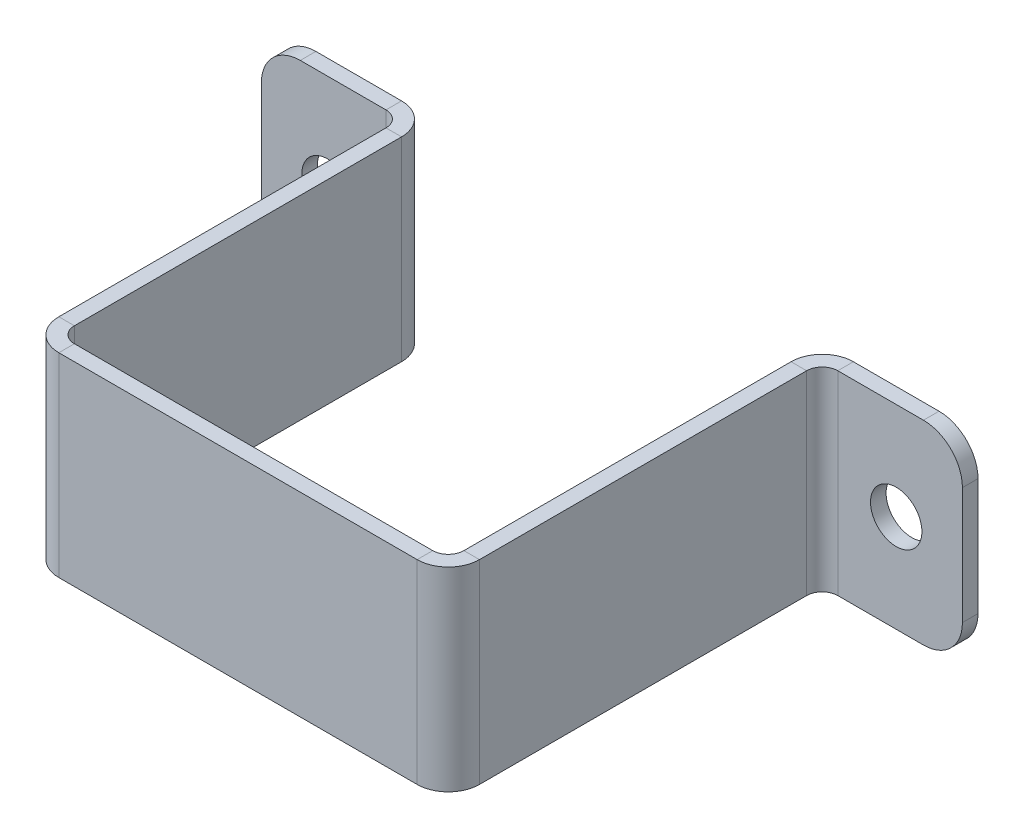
ISO-10303-21;
HEADER;
FILE_DESCRIPTION(('STEP AP214'),'2;1');
FILE_NAME('part.step','',(''),(''),'','','');
FILE_SCHEMA(('AUTOMOTIVE_DESIGN { 1 0 10303 214 1 1 1 1 }'));
ENDSEC;
DATA;
#1=APPLICATION_CONTEXT('core data for automotive mechanical design processes');
#2=APPLICATION_PROTOCOL_DEFINITION('international standard','automotive_design',2000,#1);
#3=PRODUCT_CONTEXT('',#1,'mechanical');
#4=PRODUCT('Part','Part','',(#3));
#5=PRODUCT_RELATED_PRODUCT_CATEGORY('part','',(#4));
#6=PRODUCT_DEFINITION_FORMATION('','',#4);
#7=PRODUCT_DEFINITION_CONTEXT('part definition',#1,'design');
#8=PRODUCT_DEFINITION('design','',#6,#7);
#9=PRODUCT_DEFINITION_SHAPE('','',#8);
#10=(LENGTH_UNIT() NAMED_UNIT(*) SI_UNIT(.MILLI.,.METRE.));
#11=(NAMED_UNIT(*) PLANE_ANGLE_UNIT() SI_UNIT($,.RADIAN.));
#12=(NAMED_UNIT(*) SI_UNIT($,.STERADIAN.) SOLID_ANGLE_UNIT());
#13=UNCERTAINTY_MEASURE_WITH_UNIT(LENGTH_MEASURE(1.E-05),#10,'distance_accuracy_value','');
#14=(GEOMETRIC_REPRESENTATION_CONTEXT(3) GLOBAL_UNCERTAINTY_ASSIGNED_CONTEXT((#13)) GLOBAL_UNIT_ASSIGNED_CONTEXT((#10,
#11,#12)) REPRESENTATION_CONTEXT('',''));
#15=CARTESIAN_POINT('',(0.,0.,0.));
#16=DIRECTION('',(0.,0.,1.));
#17=DIRECTION('',(1.,0.,0.));
#18=AXIS2_PLACEMENT_3D('',#15,#16,#17);
#19=CARTESIAN_POINT('',(2.00000000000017,0.,-48.));
#20=DIRECTION('',(0.,1.,0.));
#21=DIRECTION('',(0.,0.,1.));
#22=AXIS2_PLACEMENT_3D('',#19,#20,#21);
#23=PLANE('',#22);
#24=DIRECTION('',(-1.,0.,0.));
#25=VECTOR('',#24,1.);
#26=CARTESIAN_POINT('',(2.00000000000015,0.,-44.));
#27=LINE('',#26,#25);
#28=CARTESIAN_POINT('',(2.00000000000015,0.,-44.));
#29=VERTEX_POINT('',#28);
#30=CARTESIAN_POINT('',(1.53625267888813E-13,0.,-44.));
#31=VERTEX_POINT('',#30);
#32=EDGE_CURVE('E299',#29,#31,#27,.T.);
#33=ORIENTED_EDGE('',*,*,#32,.F.);
#34=DIRECTION('',(0.,0.,-1.));
#35=VECTOR('',#34,1.);
#36=CARTESIAN_POINT('',(2.00000000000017,0.,-48.));
#37=LINE('',#36,#35);
#38=CARTESIAN_POINT('',(2.00000000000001,0.,-1.99999999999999));
#39=VERTEX_POINT('',#38);
#40=EDGE_CURVE('E405',#39,#29,#37,.T.);
#41=ORIENTED_EDGE('',*,*,#40,.F.);
#42=DIRECTION('',(1.,0.,0.));
#43=VECTOR('',#42,1.);
#44=CARTESIAN_POINT('',(0.,0.,-1.99999999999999));
#45=LINE('',#44,#43);
#46=CARTESIAN_POINT('',(0.,0.,-1.99999999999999));
#47=VERTEX_POINT('',#46);
#48=EDGE_CURVE('E396',#47,#39,#45,.T.);
#49=ORIENTED_EDGE('',*,*,#48,.F.);
#50=DIRECTION('',(0.,0.,-1.));
#51=VECTOR('',#50,1.);
#52=CARTESIAN_POINT('',(1.6759120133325E-13,0.,-48.));
#53=LINE('',#52,#51);
#54=EDGE_CURVE('E404',#47,#31,#53,.T.);
#55=ORIENTED_EDGE('',*,*,#54,.T.);
#56=EDGE_LOOP('',(#33,#41,#49,#55));
#57=FACE_BOUND('',#56,.T.);
#58=ADVANCED_FACE('F74',(#57),#23,.F.);
#59=CARTESIAN_POINT('',(2.,25.,0.));
#60=DIRECTION('',(0.,-1.,0.));
#61=DIRECTION('',(0.,0.,-1.));
#62=AXIS2_PLACEMENT_3D('',#59,#60,#61);
#63=PLANE('',#62);
#64=DIRECTION('',(-1.,0.,0.));
#65=VECTOR('',#64,1.);
#66=CARTESIAN_POINT('',(2.00000000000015,25.,-44.));
#67=LINE('',#66,#65);
#68=CARTESIAN_POINT('',(2.00000000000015,25.,-44.));
#69=VERTEX_POINT('',#68);
#70=CARTESIAN_POINT('',(1.54390389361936E-13,25.,-44.));
#71=VERTEX_POINT('',#70);
#72=EDGE_CURVE('E292',#69,#71,#67,.T.);
#73=ORIENTED_EDGE('',*,*,#72,.T.);
#74=DIRECTION('',(0.,0.,1.));
#75=VECTOR('',#74,1.);
#76=CARTESIAN_POINT('',(0.,25.,0.));
#77=LINE('',#76,#75);
#78=CARTESIAN_POINT('',(0.,25.,-1.99999999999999));
#79=VERTEX_POINT('',#78);
#80=EDGE_CURVE('E409',#71,#79,#77,.T.);
#81=ORIENTED_EDGE('',*,*,#80,.T.);
#82=DIRECTION('',(1.,0.,0.));
#83=VECTOR('',#82,1.);
#84=CARTESIAN_POINT('',(0.,25.,-1.99999999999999));
#85=LINE('',#84,#83);
#86=CARTESIAN_POINT('',(2.00000000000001,25.,-1.99999999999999));
#87=VERTEX_POINT('',#86);
#88=EDGE_CURVE('E391',#79,#87,#85,.T.);
#89=ORIENTED_EDGE('',*,*,#88,.T.);
#90=DIRECTION('',(0.,0.,1.));
#91=VECTOR('',#90,1.);
#92=CARTESIAN_POINT('',(2.,25.,0.));
#93=LINE('',#92,#91);
#94=EDGE_CURVE('E408',#69,#87,#93,.T.);
#95=ORIENTED_EDGE('',*,*,#94,.F.);
#96=EDGE_LOOP('',(#73,#81,#89,#95));
#97=FACE_BOUND('',#96,.T.);
#98=ADVANCED_FACE('F548',(#97),#63,.F.);
#99=CARTESIAN_POINT('',(2.,0.,0.));
#100=DIRECTION('',(-1.,0.,0.));
#101=DIRECTION('',(0.,0.,1.));
#102=AXIS2_PLACEMENT_3D('',#99,#100,#101);
#103=PLANE('',#102);
#104=DIRECTION('',(0.,1.,0.));
#105=VECTOR('',#104,1.);
#106=CARTESIAN_POINT('',(2.00000000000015,25.,-44.));
#107=LINE('',#106,#105);
#108=EDGE_CURVE('E296',#69,#29,#107,.F.);
#109=ORIENTED_EDGE('',*,*,#108,.F.);
#110=ORIENTED_EDGE('',*,*,#94,.T.);
#111=DIRECTION('',(0.,1.,0.));
#112=VECTOR('',#111,1.);
#113=CARTESIAN_POINT('',(2.00000000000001,0.,-1.99999999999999));
#114=LINE('',#113,#112);
#115=EDGE_CURVE('E399',#39,#87,#114,.T.);
#116=ORIENTED_EDGE('',*,*,#115,.F.);
#117=ORIENTED_EDGE('',*,*,#40,.T.);
#118=EDGE_LOOP('',(#109,#110,#116,#117));
#119=FACE_BOUND('',#118,.T.);
#120=ADVANCED_FACE('F554',(#119),#103,.F.);
#121=CARTESIAN_POINT('',(0.,0.,0.));
#122=DIRECTION('',(-1.,0.,0.));
#123=DIRECTION('',(0.,0.,1.));
#124=AXIS2_PLACEMENT_3D('',#121,#122,#123);
#125=PLANE('',#124);
#126=ORIENTED_EDGE('',*,*,#80,.F.);
#127=DIRECTION('',(0.,1.,0.));
#128=VECTOR('',#127,1.);
#129=CARTESIAN_POINT('',(1.54390389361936E-13,25.,-44.));
#130=LINE('',#129,#128);
#131=EDGE_CURVE('E244',#71,#31,#130,.F.);
#132=ORIENTED_EDGE('',*,*,#131,.T.);
#133=ORIENTED_EDGE('',*,*,#54,.F.);
#134=DIRECTION('',(0.,-1.,0.));
#135=VECTOR('',#134,1.);
#136=CARTESIAN_POINT('',(0.,25.,-1.99999999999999));
#137=LINE('',#136,#135);
#138=EDGE_CURVE('E394',#79,#47,#137,.T.);
#139=ORIENTED_EDGE('',*,*,#138,.F.);
#140=EDGE_LOOP('',(#126,#132,#133,#139));
#141=FACE_BOUND('',#140,.T.);
#142=ADVANCED_FACE('F786',(#141),#125,.T.);
#143=CARTESIAN_POINT('',(-52.0000000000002,25.,-48.));
#144=DIRECTION('',(0.,-1.,0.));
#145=DIRECTION('',(0.,0.,-1.));
#146=AXIS2_PLACEMENT_3D('',#143,#144,#145);
#147=PLANE('',#146);
#148=DIRECTION('',(1.,0.,0.));
#149=VECTOR('',#148,1.);
#150=CARTESIAN_POINT('',(-52.0000000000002,25.,-44.));
#151=LINE('',#150,#149);
#152=CARTESIAN_POINT('',(-52.0000000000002,25.,-44.));
#153=VERTEX_POINT('',#152);
#154=CARTESIAN_POINT('',(-50.0000000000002,25.,-44.));
#155=VERTEX_POINT('',#154);
#156=EDGE_CURVE('E344',#153,#155,#151,.T.);
#157=ORIENTED_EDGE('',*,*,#156,.F.);
#158=DIRECTION('',(0.,0.,-1.));
#159=VECTOR('',#158,1.);
#160=CARTESIAN_POINT('',(-52.0000000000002,25.,-48.));
#161=LINE('',#160,#159);
#162=CARTESIAN_POINT('',(-52.,25.,-1.99999999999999));
#163=VERTEX_POINT('',#162);
#164=EDGE_CURVE('E361',#163,#153,#161,.T.);
#165=ORIENTED_EDGE('',*,*,#164,.F.);
#166=DIRECTION('',(-1.,0.,0.));
#167=VECTOR('',#166,1.);
#168=CARTESIAN_POINT('',(-50.,25.,-1.99999999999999));
#169=LINE('',#168,#167);
#170=CARTESIAN_POINT('',(-50.,25.,-1.99999999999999));
#171=VERTEX_POINT('',#170);
#172=EDGE_CURVE('E352',#171,#163,#169,.T.);
#173=ORIENTED_EDGE('',*,*,#172,.F.);
#174=DIRECTION('',(0.,0.,-1.));
#175=VECTOR('',#174,1.);
#176=CARTESIAN_POINT('',(-50.0000000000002,25.,-48.));
#177=LINE('',#176,#175);
#178=EDGE_CURVE('E360',#171,#155,#177,.T.);
#179=ORIENTED_EDGE('',*,*,#178,.T.);
#180=EDGE_LOOP('',(#157,#165,#173,#179));
#181=FACE_BOUND('',#180,.T.);
#182=ADVANCED_FACE('F516',(#181),#147,.F.);
#183=CARTESIAN_POINT('',(-52.,0.,0.));
#184=DIRECTION('',(0.,1.,0.));
#185=DIRECTION('',(0.,0.,1.));
#186=AXIS2_PLACEMENT_3D('',#183,#184,#185);
#187=PLANE('',#186);
#188=DIRECTION('',(1.,0.,0.));
#189=VECTOR('',#188,1.);
#190=CARTESIAN_POINT('',(-52.0000000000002,0.,-44.));
#191=LINE('',#190,#189);
#192=CARTESIAN_POINT('',(-52.0000000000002,0.,-44.));
#193=VERTEX_POINT('',#192);
#194=CARTESIAN_POINT('',(-50.0000000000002,0.,-44.));
#195=VERTEX_POINT('',#194);
#196=EDGE_CURVE('E334',#193,#195,#191,.T.);
#197=ORIENTED_EDGE('',*,*,#196,.T.);
#198=DIRECTION('',(0.,0.,1.));
#199=VECTOR('',#198,1.);
#200=CARTESIAN_POINT('',(-50.,0.,0.));
#201=LINE('',#200,#199);
#202=CARTESIAN_POINT('',(-50.,0.,-1.99999999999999));
#203=VERTEX_POINT('',#202);
#204=EDGE_CURVE('E365',#195,#203,#201,.T.);
#205=ORIENTED_EDGE('',*,*,#204,.T.);
#206=DIRECTION('',(-1.,0.,0.));
#207=VECTOR('',#206,1.);
#208=CARTESIAN_POINT('',(-50.,0.,-1.99999999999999));
#209=LINE('',#208,#207);
#210=CARTESIAN_POINT('',(-52.,0.,-1.99999999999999));
#211=VERTEX_POINT('',#210);
#212=EDGE_CURVE('E347',#203,#211,#209,.T.);
#213=ORIENTED_EDGE('',*,*,#212,.T.);
#214=DIRECTION('',(0.,0.,1.));
#215=VECTOR('',#214,1.);
#216=CARTESIAN_POINT('',(-52.,0.,0.));
#217=LINE('',#216,#215);
#218=EDGE_CURVE('E364',#193,#211,#217,.T.);
#219=ORIENTED_EDGE('',*,*,#218,.F.);
#220=EDGE_LOOP('',(#197,#205,#213,#219));
#221=FACE_BOUND('',#220,.T.);
#222=ADVANCED_FACE('F533',(#221),#187,.F.);
#223=CARTESIAN_POINT('',(-52.,25.,0.));
#224=DIRECTION('',(1.,0.,0.));
#225=DIRECTION('',(0.,0.,-1.));
#226=AXIS2_PLACEMENT_3D('',#223,#224,#225);
#227=PLANE('',#226);
#228=DIRECTION('',(0.,-1.,0.));
#229=VECTOR('',#228,1.);
#230=CARTESIAN_POINT('',(-52.0000000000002,0.,-44.));
#231=LINE('',#230,#229);
#232=EDGE_CURVE('E340',#193,#153,#231,.F.);
#233=ORIENTED_EDGE('',*,*,#232,.F.);
#234=ORIENTED_EDGE('',*,*,#218,.T.);
#235=DIRECTION('',(0.,-1.,0.));
#236=VECTOR('',#235,1.);
#237=CARTESIAN_POINT('',(-52.,25.,-1.99999999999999));
#238=LINE('',#237,#236);
#239=EDGE_CURVE('E355',#163,#211,#238,.T.);
#240=ORIENTED_EDGE('',*,*,#239,.F.);
#241=ORIENTED_EDGE('',*,*,#164,.T.);
#242=EDGE_LOOP('',(#233,#234,#240,#241));
#243=FACE_BOUND('',#242,.T.);
#244=ADVANCED_FACE('F523',(#243),#227,.F.);
#245=CARTESIAN_POINT('',(-50.,25.,0.));
#246=DIRECTION('',(1.,0.,0.));
#247=DIRECTION('',(0.,0.,-1.));
#248=AXIS2_PLACEMENT_3D('',#245,#246,#247);
#249=PLANE('',#248);
#250=ORIENTED_EDGE('',*,*,#204,.F.);
#251=DIRECTION('',(0.,-1.,0.));
#252=VECTOR('',#251,1.);
#253=CARTESIAN_POINT('',(-50.0000000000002,0.,-44.));
#254=LINE('',#253,#252);
#255=EDGE_CURVE('E327',#195,#155,#254,.F.);
#256=ORIENTED_EDGE('',*,*,#255,.T.);
#257=ORIENTED_EDGE('',*,*,#178,.F.);
#258=DIRECTION('',(0.,1.,0.));
#259=VECTOR('',#258,1.);
#260=CARTESIAN_POINT('',(-50.,0.,-1.99999999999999));
#261=LINE('',#260,#259);
#262=EDGE_CURVE('E350',#203,#171,#261,.T.);
#263=ORIENTED_EDGE('',*,*,#262,.F.);
#264=EDGE_LOOP('',(#250,#256,#257,#263));
#265=FACE_BOUND('',#264,.T.);
#266=ADVANCED_FACE('F513',(#265),#249,.T.);
#267=CARTESIAN_POINT('',(0.,25.,2.));
#268=DIRECTION('',(0.,-1.,0.));
#269=DIRECTION('',(1.,0.,0.));
#270=AXIS2_PLACEMENT_3D('',#267,#268,#269);
#271=PLANE('',#270);
#272=DIRECTION('',(0.,0.,1.));
#273=VECTOR('',#272,1.);
#274=CARTESIAN_POINT('',(-48.,25.,0.));
#275=LINE('',#274,#273);
#276=CARTESIAN_POINT('',(-48.,25.,0.));
#277=VERTEX_POINT('',#276);
#278=CARTESIAN_POINT('',(-48.,25.,2.));
#279=VERTEX_POINT('',#278);
#280=EDGE_CURVE('E378',#277,#279,#275,.T.);
#281=ORIENTED_EDGE('',*,*,#280,.T.);
#282=DIRECTION('',(-1.,0.,0.));
#283=VECTOR('',#282,1.);
#284=CARTESIAN_POINT('',(0.,25.,2.));
#285=LINE('',#284,#283);
#286=CARTESIAN_POINT('',(-1.99999999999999,25.,2.));
#287=VERTEX_POINT('',#286);
#288=EDGE_CURVE('E438',#287,#279,#285,.T.);
#289=ORIENTED_EDGE('',*,*,#288,.F.);
#290=DIRECTION('',(0.,0.,1.));
#291=VECTOR('',#290,1.);
#292=CARTESIAN_POINT('',(-1.99999999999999,25.,0.));
#293=LINE('',#292,#291);
#294=CARTESIAN_POINT('',(-1.99999999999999,25.,0.));
#295=VERTEX_POINT('',#294);
#296=EDGE_CURVE('E432',#295,#287,#293,.T.);
#297=ORIENTED_EDGE('',*,*,#296,.F.);
#298=DIRECTION('',(-1.,0.,0.));
#299=VECTOR('',#298,1.);
#300=CARTESIAN_POINT('',(0.,25.,0.));
#301=LINE('',#300,#299);
#302=EDGE_CURVE('E435',#295,#277,#301,.T.);
#303=ORIENTED_EDGE('',*,*,#302,.T.);
#304=EDGE_LOOP('',(#281,#289,#297,#303));
#305=FACE_BOUND('',#304,.T.);
#306=ADVANCED_FACE('F587',(#305),#271,.F.);
#307=CARTESIAN_POINT('',(0.,0.,2.));
#308=DIRECTION('',(0.,1.,0.));
#309=DIRECTION('',(-1.,0.,0.));
#310=AXIS2_PLACEMENT_3D('',#307,#308,#309);
#311=PLANE('',#310);
#312=DIRECTION('',(0.,0.,1.));
#313=VECTOR('',#312,1.);
#314=CARTESIAN_POINT('',(-48.,0.,0.));
#315=LINE('',#314,#313);
#316=CARTESIAN_POINT('',(-48.,0.,0.));
#317=VERTEX_POINT('',#316);
#318=CARTESIAN_POINT('',(-48.,0.,2.));
#319=VERTEX_POINT('',#318);
#320=EDGE_CURVE('E388',#317,#319,#315,.T.);
#321=ORIENTED_EDGE('',*,*,#320,.F.);
#322=DIRECTION('',(1.,0.,0.));
#323=VECTOR('',#322,1.);
#324=CARTESIAN_POINT('',(0.,0.,0.));
#325=LINE('',#324,#323);
#326=CARTESIAN_POINT('',(-1.99999999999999,0.,0.));
#327=VERTEX_POINT('',#326);
#328=EDGE_CURVE('E442',#317,#327,#325,.T.);
#329=ORIENTED_EDGE('',*,*,#328,.T.);
#330=DIRECTION('',(0.,0.,1.));
#331=VECTOR('',#330,1.);
#332=CARTESIAN_POINT('',(-1.99999999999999,0.,0.));
#333=LINE('',#332,#331);
#334=CARTESIAN_POINT('',(-1.99999999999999,0.,2.));
#335=VERTEX_POINT('',#334);
#336=EDGE_CURVE('E422',#327,#335,#333,.T.);
#337=ORIENTED_EDGE('',*,*,#336,.T.);
#338=DIRECTION('',(1.,0.,0.));
#339=VECTOR('',#338,1.);
#340=CARTESIAN_POINT('',(0.,0.,2.));
#341=LINE('',#340,#339);
#342=EDGE_CURVE('E441',#319,#335,#341,.T.);
#343=ORIENTED_EDGE('',*,*,#342,.F.);
#344=EDGE_LOOP('',(#321,#329,#337,#343));
#345=FACE_BOUND('',#344,.T.);
#346=ADVANCED_FACE('F580',(#345),#311,.F.);
#347=CARTESIAN_POINT('',(0.,25.,2.));
#348=DIRECTION('',(0.,0.,1.));
#349=DIRECTION('',(1.,0.,0.));
#350=AXIS2_PLACEMENT_3D('',#347,#348,#349);
#351=PLANE('',#350);
#352=ORIENTED_EDGE('',*,*,#288,.T.);
#353=DIRECTION('',(0.,1.,0.));
#354=VECTOR('',#353,1.);
#355=CARTESIAN_POINT('',(-48.,25.,2.));
#356=LINE('',#355,#354);
#357=EDGE_CURVE('E371',#279,#319,#356,.F.);
#358=ORIENTED_EDGE('',*,*,#357,.T.);
#359=ORIENTED_EDGE('',*,*,#342,.T.);
#360=DIRECTION('',(0.,-1.,0.));
#361=VECTOR('',#360,1.);
#362=CARTESIAN_POINT('',(-1.99999999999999,0.,2.));
#363=LINE('',#362,#361);
#364=EDGE_CURVE('E415',#335,#287,#363,.F.);
#365=ORIENTED_EDGE('',*,*,#364,.T.);
#366=EDGE_LOOP('',(#352,#358,#359,#365));
#367=FACE_BOUND('',#366,.T.);
#368=ADVANCED_FACE('F577',(#367),#351,.T.);
#369=CARTESIAN_POINT('',(0.,25.,0.));
#370=DIRECTION('',(0.,0.,1.));
#371=DIRECTION('',(1.,0.,0.));
#372=AXIS2_PLACEMENT_3D('',#369,#370,#371);
#373=PLANE('',#372);
#374=DIRECTION('',(0.,1.,0.));
#375=VECTOR('',#374,1.);
#376=CARTESIAN_POINT('',(-48.,25.,0.));
#377=LINE('',#376,#375);
#378=EDGE_CURVE('E384',#277,#317,#377,.F.);
#379=ORIENTED_EDGE('',*,*,#378,.F.);
#380=ORIENTED_EDGE('',*,*,#302,.F.);
#381=DIRECTION('',(0.,-1.,0.));
#382=VECTOR('',#381,1.);
#383=CARTESIAN_POINT('',(-1.99999999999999,0.,0.));
#384=LINE('',#383,#382);
#385=EDGE_CURVE('E428',#327,#295,#384,.F.);
#386=ORIENTED_EDGE('',*,*,#385,.F.);
#387=ORIENTED_EDGE('',*,*,#328,.F.);
#388=EDGE_LOOP('',(#379,#380,#386,#387));
#389=FACE_BOUND('',#388,.T.);
#390=ADVANCED_FACE('F572',(#389),#373,.F.);
#391=CARTESIAN_POINT('',(-1.99999999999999,25.,-2.));
#392=DIRECTION('',(0.,1.,0.));
#393=DIRECTION('',(0.,0.,1.));
#394=AXIS2_PLACEMENT_3D('',#391,#392,#393);
#395=PLANE('',#394);
#396=ORIENTED_EDGE('',*,*,#88,.F.);
#397=CARTESIAN_POINT('',(-1.99999999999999,25.,-2.));
#398=DIRECTION('',(0.,-1.,0.));
#399=DIRECTION('',(0.,0.,-1.));
#400=AXIS2_PLACEMENT_3D('',#397,#398,#399);
#401=CIRCLE('',#400,2.);
#402=EDGE_CURVE('E425',#295,#79,#401,.F.);
#403=ORIENTED_EDGE('',*,*,#402,.F.);
#404=ORIENTED_EDGE('',*,*,#296,.T.);
#405=CARTESIAN_POINT('',(-1.99999999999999,25.,-2.));
#406=DIRECTION('',(0.,-1.,0.));
#407=DIRECTION('',(0.,0.,-1.));
#408=AXIS2_PLACEMENT_3D('',#405,#406,#407);
#409=CIRCLE('',#408,4.);
#410=EDGE_CURVE('E418',#287,#87,#409,.F.);
#411=ORIENTED_EDGE('',*,*,#410,.T.);
#412=EDGE_LOOP('',(#396,#403,#404,#411));
#413=FACE_BOUND('',#412,.T.);
#414=ADVANCED_FACE('F566',(#413),#395,.T.);
#415=CARTESIAN_POINT('',(-1.99999999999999,0.,-2.));
#416=DIRECTION('',(0.,1.,0.));
#417=DIRECTION('',(0.,0.,1.));
#418=AXIS2_PLACEMENT_3D('',#415,#416,#417);
#419=PLANE('',#418);
#420=CARTESIAN_POINT('',(-1.99999999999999,0.,-2.));
#421=DIRECTION('',(0.,-1.,0.));
#422=DIRECTION('',(0.,0.,-1.));
#423=AXIS2_PLACEMENT_3D('',#420,#421,#422);
#424=CIRCLE('',#423,2.);
#425=EDGE_CURVE('E411',#47,#327,#424,.T.);
#426=ORIENTED_EDGE('',*,*,#425,.F.);
#427=ORIENTED_EDGE('',*,*,#48,.T.);
#428=CARTESIAN_POINT('',(-1.99999999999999,0.,-2.));
#429=DIRECTION('',(0.,-1.,0.));
#430=DIRECTION('',(0.,0.,-1.));
#431=AXIS2_PLACEMENT_3D('',#428,#429,#430);
#432=CIRCLE('',#431,4.);
#433=EDGE_CURVE('E419',#39,#335,#432,.T.);
#434=ORIENTED_EDGE('',*,*,#433,.T.);
#435=ORIENTED_EDGE('',*,*,#336,.F.);
#436=EDGE_LOOP('',(#426,#427,#434,#435));
#437=FACE_BOUND('',#436,.T.);
#438=ADVANCED_FACE('F564',(#437),#419,.F.);
#439=CARTESIAN_POINT('',(-1.99999999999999,0.,-2.));
#440=DIRECTION('',(0.,-1.,0.));
#441=DIRECTION('',(1.,0.,0.));
#442=AXIS2_PLACEMENT_3D('',#439,#440,#441);
#443=CYLINDRICAL_SURFACE('',#442,4.);
#444=ORIENTED_EDGE('',*,*,#364,.F.);
#445=ORIENTED_EDGE('',*,*,#433,.F.);
#446=ORIENTED_EDGE('',*,*,#115,.T.);
#447=ORIENTED_EDGE('',*,*,#410,.F.);
#448=EDGE_LOOP('',(#444,#445,#446,#447));
#449=FACE_BOUND('',#448,.T.);
#450=ADVANCED_FACE('F560',(#449),#443,.T.);
#451=CARTESIAN_POINT('',(-1.99999999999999,0.,-2.));
#452=DIRECTION('',(0.,-1.,0.));
#453=DIRECTION('',(1.,0.,0.));
#454=AXIS2_PLACEMENT_3D('',#451,#452,#453);
#455=CYLINDRICAL_SURFACE('',#454,2.);
#456=ORIENTED_EDGE('',*,*,#385,.T.);
#457=ORIENTED_EDGE('',*,*,#402,.T.);
#458=ORIENTED_EDGE('',*,*,#138,.T.);
#459=ORIENTED_EDGE('',*,*,#425,.T.);
#460=EDGE_LOOP('',(#456,#457,#458,#459));
#461=FACE_BOUND('',#460,.T.);
#462=ADVANCED_FACE('F563',(#461),#455,.F.);
#463=CARTESIAN_POINT('',(-48.,0.,-2.));
#464=DIRECTION('',(0.,-1.,0.));
#465=DIRECTION('',(0.,0.,-1.));
#466=AXIS2_PLACEMENT_3D('',#463,#464,#465);
#467=PLANE('',#466);
#468=ORIENTED_EDGE('',*,*,#212,.F.);
#469=CARTESIAN_POINT('',(-48.,0.,-2.));
#470=DIRECTION('',(0.,1.,0.));
#471=DIRECTION('',(0.,0.,1.));
#472=AXIS2_PLACEMENT_3D('',#469,#470,#471);
#473=CIRCLE('',#472,2.);
#474=EDGE_CURVE('E381',#317,#203,#473,.F.);
#475=ORIENTED_EDGE('',*,*,#474,.F.);
#476=ORIENTED_EDGE('',*,*,#320,.T.);
#477=CARTESIAN_POINT('',(-48.,0.,-2.));
#478=DIRECTION('',(0.,1.,0.));
#479=DIRECTION('',(0.,0.,1.));
#480=AXIS2_PLACEMENT_3D('',#477,#478,#479);
#481=CIRCLE('',#480,4.);
#482=EDGE_CURVE('E374',#319,#211,#481,.F.);
#483=ORIENTED_EDGE('',*,*,#482,.T.);
#484=EDGE_LOOP('',(#468,#475,#476,#483));
#485=FACE_BOUND('',#484,.T.);
#486=ADVANCED_FACE('F529',(#485),#467,.T.);
#487=CARTESIAN_POINT('',(-48.,25.,-2.));
#488=DIRECTION('',(0.,-1.,0.));
#489=DIRECTION('',(0.,0.,-1.));
#490=AXIS2_PLACEMENT_3D('',#487,#488,#489);
#491=PLANE('',#490);
#492=CARTESIAN_POINT('',(-48.,25.,-2.));
#493=DIRECTION('',(0.,1.,0.));
#494=DIRECTION('',(0.,0.,1.));
#495=AXIS2_PLACEMENT_3D('',#492,#493,#494);
#496=CIRCLE('',#495,2.);
#497=EDGE_CURVE('E367',#171,#277,#496,.T.);
#498=ORIENTED_EDGE('',*,*,#497,.F.);
#499=ORIENTED_EDGE('',*,*,#172,.T.);
#500=CARTESIAN_POINT('',(-48.,25.,-2.));
#501=DIRECTION('',(0.,1.,0.));
#502=DIRECTION('',(0.,0.,1.));
#503=AXIS2_PLACEMENT_3D('',#500,#501,#502);
#504=CIRCLE('',#503,4.);
#505=EDGE_CURVE('E375',#163,#279,#504,.T.);
#506=ORIENTED_EDGE('',*,*,#505,.T.);
#507=ORIENTED_EDGE('',*,*,#280,.F.);
#508=EDGE_LOOP('',(#498,#499,#506,#507));
#509=FACE_BOUND('',#508,.T.);
#510=ADVANCED_FACE('F520',(#509),#491,.F.);
#511=CARTESIAN_POINT('',(-48.,25.,-2.));
#512=DIRECTION('',(0.,1.,0.));
#513=DIRECTION('',(-1.,0.,0.));
#514=AXIS2_PLACEMENT_3D('',#511,#512,#513);
#515=CYLINDRICAL_SURFACE('',#514,4.);
#516=ORIENTED_EDGE('',*,*,#357,.F.);
#517=ORIENTED_EDGE('',*,*,#505,.F.);
#518=ORIENTED_EDGE('',*,*,#239,.T.);
#519=ORIENTED_EDGE('',*,*,#482,.F.);
#520=EDGE_LOOP('',(#516,#517,#518,#519));
#521=FACE_BOUND('',#520,.T.);
#522=ADVANCED_FACE('F526',(#521),#515,.T.);
#523=CARTESIAN_POINT('',(-48.,25.,-2.));
#524=DIRECTION('',(0.,1.,0.));
#525=DIRECTION('',(-1.,0.,0.));
#526=AXIS2_PLACEMENT_3D('',#523,#524,#525);
#527=CYLINDRICAL_SURFACE('',#526,2.);
#528=ORIENTED_EDGE('',*,*,#378,.T.);
#529=ORIENTED_EDGE('',*,*,#474,.T.);
#530=ORIENTED_EDGE('',*,*,#262,.T.);
#531=ORIENTED_EDGE('',*,*,#497,.T.);
#532=EDGE_LOOP('',(#528,#529,#530,#531));
#533=FACE_BOUND('',#532,.T.);
#534=ADVANCED_FACE('F835',(#533),#527,.F.);
#535=CARTESIAN_POINT('',(-54.0000000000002,25.,-44.));
#536=DIRECTION('',(0.,1.,0.));
#537=DIRECTION('',(0.,0.,1.));
#538=AXIS2_PLACEMENT_3D('',#535,#536,#537);
#539=PLANE('',#538);
#540=DIRECTION('',(0.,0.,1.));
#541=VECTOR('',#540,1.);
#542=CARTESIAN_POINT('',(-54.0000000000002,25.,-48.));
#543=LINE('',#542,#541);
#544=CARTESIAN_POINT('',(-54.0000000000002,25.,-46.));
#545=VERTEX_POINT('',#544);
#546=CARTESIAN_POINT('',(-54.0000000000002,25.,-48.));
#547=VERTEX_POINT('',#546);
#548=EDGE_CURVE('E302',#545,#547,#543,.F.);
#549=ORIENTED_EDGE('',*,*,#548,.F.);
#550=CARTESIAN_POINT('',(-54.0000000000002,25.,-44.));
#551=DIRECTION('',(0.,-1.,0.));
#552=DIRECTION('',(0.,0.,-1.));
#553=AXIS2_PLACEMENT_3D('',#550,#551,#552);
#554=CIRCLE('',#553,2.);
#555=EDGE_CURVE('E337',#153,#545,#554,.F.);
#556=ORIENTED_EDGE('',*,*,#555,.F.);
#557=ORIENTED_EDGE('',*,*,#156,.T.);
#558=CARTESIAN_POINT('',(-54.0000000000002,25.,-44.));
#559=DIRECTION('',(0.,-1.,0.));
#560=DIRECTION('',(0.,0.,-1.));
#561=AXIS2_PLACEMENT_3D('',#558,#559,#560);
#562=CIRCLE('',#561,4.);
#563=EDGE_CURVE('E330',#155,#547,#562,.F.);
#564=ORIENTED_EDGE('',*,*,#563,.T.);
#565=EDGE_LOOP('',(#549,#556,#557,#564));
#566=FACE_BOUND('',#565,.T.);
#567=ADVANCED_FACE('F505',(#566),#539,.T.);
#568=CARTESIAN_POINT('',(-54.0000000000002,0.,-44.));
#569=DIRECTION('',(0.,1.,0.));
#570=DIRECTION('',(0.,0.,1.));
#571=AXIS2_PLACEMENT_3D('',#568,#569,#570);
#572=PLANE('',#571);
#573=CARTESIAN_POINT('',(-54.0000000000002,0.,-44.));
#574=DIRECTION('',(0.,-1.,0.));
#575=DIRECTION('',(0.,0.,-1.));
#576=AXIS2_PLACEMENT_3D('',#573,#574,#575);
#577=CIRCLE('',#576,2.);
#578=CARTESIAN_POINT('',(-54.0000000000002,0.,-46.));
#579=VERTEX_POINT('',#578);
#580=EDGE_CURVE('E306',#579,#193,#577,.T.);
#581=ORIENTED_EDGE('',*,*,#580,.F.);
#582=DIRECTION('',(0.,0.,1.));
#583=VECTOR('',#582,1.);
#584=CARTESIAN_POINT('',(-54.0000000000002,0.,-46.));
#585=LINE('',#584,#583);
#586=CARTESIAN_POINT('',(-54.0000000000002,0.,-48.));
#587=VERTEX_POINT('',#586);
#588=EDGE_CURVE('E320',#579,#587,#585,.F.);
#589=ORIENTED_EDGE('',*,*,#588,.T.);
#590=CARTESIAN_POINT('',(-54.0000000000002,0.,-44.));
#591=DIRECTION('',(0.,-1.,0.));
#592=DIRECTION('',(0.,0.,-1.));
#593=AXIS2_PLACEMENT_3D('',#590,#591,#592);
#594=CIRCLE('',#593,4.);
#595=EDGE_CURVE('E331',#587,#195,#594,.T.);
#596=ORIENTED_EDGE('',*,*,#595,.T.);
#597=ORIENTED_EDGE('',*,*,#196,.F.);
#598=EDGE_LOOP('',(#581,#589,#596,#597));
#599=FACE_BOUND('',#598,.T.);
#600=ADVANCED_FACE('F501',(#599),#572,.F.);
#601=CARTESIAN_POINT('',(-54.0000000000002,0.,-44.));
#602=DIRECTION('',(0.,-1.,0.));
#603=DIRECTION('',(0.,0.,-1.));
#604=AXIS2_PLACEMENT_3D('',#601,#602,#603);
#605=CYLINDRICAL_SURFACE('',#604,4.);
#606=ORIENTED_EDGE('',*,*,#255,.F.);
#607=ORIENTED_EDGE('',*,*,#595,.F.);
#608=DIRECTION('',(0.,-1.,0.));
#609=VECTOR('',#608,1.);
#610=CARTESIAN_POINT('',(-54.0000000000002,25.,-48.));
#611=LINE('',#610,#609);
#612=EDGE_CURVE('E317',#587,#547,#611,.F.);
#613=ORIENTED_EDGE('',*,*,#612,.T.);
#614=ORIENTED_EDGE('',*,*,#563,.F.);
#615=EDGE_LOOP('',(#606,#607,#613,#614));
#616=FACE_BOUND('',#615,.T.);
#617=ADVANCED_FACE('F503',(#616),#605,.T.);
#618=CARTESIAN_POINT('',(-54.0000000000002,0.,-44.));
#619=DIRECTION('',(0.,-1.,0.));
#620=DIRECTION('',(0.,0.,-1.));
#621=AXIS2_PLACEMENT_3D('',#618,#619,#620);
#622=CYLINDRICAL_SURFACE('',#621,2.);
#623=ORIENTED_EDGE('',*,*,#232,.T.);
#624=ORIENTED_EDGE('',*,*,#555,.T.);
#625=DIRECTION('',(0.,-1.,0.));
#626=VECTOR('',#625,1.);
#627=CARTESIAN_POINT('',(-54.0000000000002,25.,-46.));
#628=LINE('',#627,#626);
#629=EDGE_CURVE('E323',#545,#579,#628,.T.);
#630=ORIENTED_EDGE('',*,*,#629,.T.);
#631=ORIENTED_EDGE('',*,*,#580,.T.);
#632=EDGE_LOOP('',(#623,#624,#630,#631));
#633=FACE_BOUND('',#632,.T.);
#634=ADVANCED_FACE('F535',(#633),#622,.F.);
#635=CARTESIAN_POINT('',(-52.0000000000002,25.,-48.));
#636=DIRECTION('',(0.,-1.,0.));
#637=DIRECTION('',(0.,0.,-1.));
#638=AXIS2_PLACEMENT_3D('',#635,#636,#637);
#639=PLANE('',#638);
#640=DIRECTION('',(1.,0.,0.));
#641=VECTOR('',#640,1.);
#642=CARTESIAN_POINT('',(-70.0000000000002,25.,-48.));
#643=LINE('',#642,#641);
#644=CARTESIAN_POINT('',(-65.0000000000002,25.,-48.));
#645=VERTEX_POINT('',#644);
#646=EDGE_CURVE('E309',#645,#547,#643,.T.);
#647=ORIENTED_EDGE('',*,*,#646,.F.);
#648=DIRECTION('',(0.,0.,1.));
#649=VECTOR('',#648,1.);
#650=CARTESIAN_POINT('',(-65.0000000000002,25.,-48.));
#651=LINE('',#650,#649);
#652=CARTESIAN_POINT('',(-65.0000000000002,25.,-46.));
#653=VERTEX_POINT('',#652);
#654=EDGE_CURVE('E464',#645,#653,#651,.T.);
#655=ORIENTED_EDGE('',*,*,#654,.T.);
#656=DIRECTION('',(-1.,0.,0.));
#657=VECTOR('',#656,1.);
#658=CARTESIAN_POINT('',(-52.0000000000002,25.,-46.));
#659=LINE('',#658,#657);
#660=EDGE_CURVE('E315',#653,#545,#659,.F.);
#661=ORIENTED_EDGE('',*,*,#660,.T.);
#662=ORIENTED_EDGE('',*,*,#548,.T.);
#663=EDGE_LOOP('',(#647,#655,#661,#662));
#664=FACE_BOUND('',#663,.T.);
#665=ADVANCED_FACE('F484',(#664),#639,.F.);
#666=CARTESIAN_POINT('',(-70.0000000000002,0.,-48.));
#667=DIRECTION('',(0.,1.,0.));
#668=DIRECTION('',(0.,0.,1.));
#669=AXIS2_PLACEMENT_3D('',#666,#667,#668);
#670=PLANE('',#669);
#671=DIRECTION('',(1.,0.,0.));
#672=VECTOR('',#671,1.);
#673=CARTESIAN_POINT('',(-70.0000000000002,0.,-46.));
#674=LINE('',#673,#672);
#675=CARTESIAN_POINT('',(-65.0000000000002,0.,-46.));
#676=VERTEX_POINT('',#675);
#677=EDGE_CURVE('E313',#579,#676,#674,.F.);
#678=ORIENTED_EDGE('',*,*,#677,.T.);
#679=DIRECTION('',(0.,0.,1.));
#680=VECTOR('',#679,1.);
#681=CARTESIAN_POINT('',(-65.0000000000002,0.,-48.));
#682=LINE('',#681,#680);
#683=CARTESIAN_POINT('',(-65.0000000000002,0.,-48.));
#684=VERTEX_POINT('',#683);
#685=EDGE_CURVE('E13',#676,#684,#682,.F.);
#686=ORIENTED_EDGE('',*,*,#685,.T.);
#687=DIRECTION('',(-1.,0.,0.));
#688=VECTOR('',#687,1.);
#689=CARTESIAN_POINT('',(-70.0000000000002,0.,-48.));
#690=LINE('',#689,#688);
#691=EDGE_CURVE('E307',#587,#684,#690,.T.);
#692=ORIENTED_EDGE('',*,*,#691,.F.);
#693=ORIENTED_EDGE('',*,*,#588,.F.);
#694=EDGE_LOOP('',(#678,#686,#692,#693));
#695=FACE_BOUND('',#694,.T.);
#696=ADVANCED_FACE('F498',(#695),#670,.F.);
#697=CARTESIAN_POINT('',(-70.0000000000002,25.,-48.));
#698=DIRECTION('',(0.,0.,1.));
#699=DIRECTION('',(1.,0.,0.));
#700=AXIS2_PLACEMENT_3D('',#697,#698,#699);
#701=PLANE('',#700);
#702=CARTESIAN_POINT('',(-61.4999999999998,12.5,-48.));
#703=DIRECTION('',(0.,0.,1.));
#704=DIRECTION('',(1.,0.,0.));
#705=AXIS2_PLACEMENT_3D('',#702,#703,#704);
#706=CIRCLE('',#705,3.3);
#707=CARTESIAN_POINT('',(-58.1999999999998,12.5,-48.));
#708=VERTEX_POINT('',#707);
#709=EDGE_CURVE('E1020',#708,#708,#706,.T.);
#710=ORIENTED_EDGE('',*,*,#709,.T.);
#711=EDGE_LOOP('',(#710));
#712=FACE_BOUND('',#711,.T.);
#713=DIRECTION('',(0.,1.,0.));
#714=VECTOR('',#713,1.);
#715=CARTESIAN_POINT('',(-70.0000000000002,25.,-48.));
#716=LINE('',#715,#714);
#717=CARTESIAN_POINT('',(-70.0000000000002,4.99999999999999,-48.));
#718=VERTEX_POINT('',#717);
#719=CARTESIAN_POINT('',(-70.0000000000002,20.,-48.));
#720=VERTEX_POINT('',#719);
#721=EDGE_CURVE('E304',#718,#720,#716,.T.);
#722=ORIENTED_EDGE('',*,*,#721,.T.);
#723=CARTESIAN_POINT('',(-65.0000000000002,20.,-48.));
#724=DIRECTION('',(0.,0.,1.));
#725=DIRECTION('',(1.,0.,0.));
#726=AXIS2_PLACEMENT_3D('',#723,#724,#725);
#727=CIRCLE('',#726,5.);
#728=EDGE_CURVE('E82',#720,#645,#727,.F.);
#729=ORIENTED_EDGE('',*,*,#728,.T.);
#730=ORIENTED_EDGE('',*,*,#646,.T.);
#731=ORIENTED_EDGE('',*,*,#612,.F.);
#732=ORIENTED_EDGE('',*,*,#691,.T.);
#733=CARTESIAN_POINT('',(-65.0000000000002,4.99999999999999,-48.));
#734=DIRECTION('',(0.,0.,1.));
#735=DIRECTION('',(1.,0.,0.));
#736=AXIS2_PLACEMENT_3D('',#733,#734,#735);
#737=CIRCLE('',#736,5.);
#738=EDGE_CURVE('E475',#684,#718,#737,.F.);
#739=ORIENTED_EDGE('',*,*,#738,.T.);
#740=EDGE_LOOP('',(#722,#729,#730,#731,#732,#739));
#741=FACE_BOUND('',#740,.T.);
#742=ADVANCED_FACE('F479',(#712,#741),#701,.F.);
#743=CARTESIAN_POINT('',(-70.0000000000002,25.,-46.));
#744=DIRECTION('',(0.,0.,1.));
#745=DIRECTION('',(1.,0.,0.));
#746=AXIS2_PLACEMENT_3D('',#743,#744,#745);
#747=PLANE('',#746);
#748=CARTESIAN_POINT('',(-61.4999999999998,12.5,-46.));
#749=DIRECTION('',(0.,0.,1.));
#750=DIRECTION('',(1.,0.,0.));
#751=AXIS2_PLACEMENT_3D('',#748,#749,#750);
#752=CIRCLE('',#751,3.3);
#753=CARTESIAN_POINT('',(-58.1999999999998,12.5,-46.));
#754=VERTEX_POINT('',#753);
#755=EDGE_CURVE('E1023',#754,#754,#752,.T.);
#756=ORIENTED_EDGE('',*,*,#755,.F.);
#757=EDGE_LOOP('',(#756));
#758=FACE_BOUND('',#757,.T.);
#759=ORIENTED_EDGE('',*,*,#660,.F.);
#760=CARTESIAN_POINT('',(-65.0000000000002,20.,-46.));
#761=DIRECTION('',(0.,0.,1.));
#762=DIRECTION('',(1.,0.,0.));
#763=AXIS2_PLACEMENT_3D('',#760,#761,#762);
#764=CIRCLE('',#763,5.);
#765=CARTESIAN_POINT('',(-70.0000000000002,20.,-46.));
#766=VERTEX_POINT('',#765);
#767=EDGE_CURVE('E469',#653,#766,#764,.T.);
#768=ORIENTED_EDGE('',*,*,#767,.T.);
#769=DIRECTION('',(0.,-1.,0.));
#770=VECTOR('',#769,1.);
#771=CARTESIAN_POINT('',(-70.0000000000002,25.,-46.));
#772=LINE('',#771,#770);
#773=CARTESIAN_POINT('',(-70.0000000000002,4.99999999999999,-46.));
#774=VERTEX_POINT('',#773);
#775=EDGE_CURVE('E311',#774,#766,#772,.F.);
#776=ORIENTED_EDGE('',*,*,#775,.F.);
#777=CARTESIAN_POINT('',(-65.0000000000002,4.99999999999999,-46.));
#778=DIRECTION('',(0.,0.,1.));
#779=DIRECTION('',(1.,0.,0.));
#780=AXIS2_PLACEMENT_3D('',#777,#778,#779);
#781=CIRCLE('',#780,5.);
#782=EDGE_CURVE('E467',#774,#676,#781,.T.);
#783=ORIENTED_EDGE('',*,*,#782,.T.);
#784=ORIENTED_EDGE('',*,*,#677,.F.);
#785=ORIENTED_EDGE('',*,*,#629,.F.);
#786=EDGE_LOOP('',(#759,#768,#776,#783,#784,#785));
#787=FACE_BOUND('',#786,.T.);
#788=ADVANCED_FACE('F490',(#758,#787),#747,.T.);
#789=CARTESIAN_POINT('',(-70.0000000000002,25.,-48.));
#790=DIRECTION('',(1.,0.,0.));
#791=DIRECTION('',(0.,0.,-1.));
#792=AXIS2_PLACEMENT_3D('',#789,#790,#791);
#793=PLANE('',#792);
#794=ORIENTED_EDGE('',*,*,#775,.T.);
#795=DIRECTION('',(0.,0.,1.));
#796=VECTOR('',#795,1.);
#797=CARTESIAN_POINT('',(-70.0000000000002,20.,-48.));
#798=LINE('',#797,#796);
#799=EDGE_CURVE('E95',#766,#720,#798,.F.);
#800=ORIENTED_EDGE('',*,*,#799,.T.);
#801=ORIENTED_EDGE('',*,*,#721,.F.);
#802=DIRECTION('',(0.,0.,1.));
#803=VECTOR('',#802,1.);
#804=CARTESIAN_POINT('',(-70.0000000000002,4.99999999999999,-48.));
#805=LINE('',#804,#803);
#806=EDGE_CURVE('E471',#718,#774,#805,.T.);
#807=ORIENTED_EDGE('',*,*,#806,.T.);
#808=EDGE_LOOP('',(#794,#800,#801,#807));
#809=FACE_BOUND('',#808,.T.);
#810=ADVANCED_FACE('F492',(#809),#793,.F.);
#811=CARTESIAN_POINT('',(4.00000000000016,0.,-44.));
#812=DIRECTION('',(0.,-1.,0.));
#813=DIRECTION('',(0.,0.,-1.));
#814=AXIS2_PLACEMENT_3D('',#811,#812,#813);
#815=PLANE('',#814);
#816=DIRECTION('',(0.,0.,1.));
#817=VECTOR('',#816,1.);
#818=CARTESIAN_POINT('',(4.00000000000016,0.,-48.));
#819=LINE('',#818,#817);
#820=CARTESIAN_POINT('',(4.00000000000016,0.,-46.));
#821=VERTEX_POINT('',#820);
#822=CARTESIAN_POINT('',(4.00000000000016,0.,-48.));
#823=VERTEX_POINT('',#822);
#824=EDGE_CURVE('E286',#821,#823,#819,.F.);
#825=ORIENTED_EDGE('',*,*,#824,.F.);
#826=CARTESIAN_POINT('',(4.00000000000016,0.,-44.));
#827=DIRECTION('',(0.,1.,0.));
#828=DIRECTION('',(0.,0.,1.));
#829=AXIS2_PLACEMENT_3D('',#826,#827,#828);
#830=CIRCLE('',#829,2.);
#831=EDGE_CURVE('E247',#29,#821,#830,.F.);
#832=ORIENTED_EDGE('',*,*,#831,.F.);
#833=ORIENTED_EDGE('',*,*,#32,.T.);
#834=CARTESIAN_POINT('',(4.00000000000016,0.,-44.));
#835=DIRECTION('',(0.,1.,0.));
#836=DIRECTION('',(0.,0.,1.));
#837=AXIS2_PLACEMENT_3D('',#834,#835,#836);
#838=CIRCLE('',#837,4.);
#839=EDGE_CURVE('E291',#31,#823,#838,.F.);
#840=ORIENTED_EDGE('',*,*,#839,.T.);
#841=EDGE_LOOP('',(#825,#832,#833,#840));
#842=FACE_BOUND('',#841,.T.);
#843=ADVANCED_FACE('F691',(#842),#815,.T.);
#844=CARTESIAN_POINT('',(4.00000000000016,25.,-44.));
#845=DIRECTION('',(0.,-1.,0.));
#846=DIRECTION('',(0.,0.,-1.));
#847=AXIS2_PLACEMENT_3D('',#844,#845,#846);
#848=PLANE('',#847);
#849=CARTESIAN_POINT('',(4.00000000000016,25.,-44.));
#850=DIRECTION('',(0.,1.,0.));
#851=DIRECTION('',(0.,0.,1.));
#852=AXIS2_PLACEMENT_3D('',#849,#850,#851);
#853=CIRCLE('',#852,2.);
#854=CARTESIAN_POINT('',(4.00000000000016,25.,-46.));
#855=VERTEX_POINT('',#854);
#856=EDGE_CURVE('E254',#855,#69,#853,.T.);
#857=ORIENTED_EDGE('',*,*,#856,.F.);
#858=DIRECTION('',(0.,0.,1.));
#859=VECTOR('',#858,1.);
#860=CARTESIAN_POINT('',(4.00000000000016,25.,-46.));
#861=LINE('',#860,#859);
#862=CARTESIAN_POINT('',(4.00000000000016,25.,-48.));
#863=VERTEX_POINT('',#862);
#864=EDGE_CURVE('E251',#855,#863,#861,.F.);
#865=ORIENTED_EDGE('',*,*,#864,.T.);
#866=CARTESIAN_POINT('',(4.00000000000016,25.,-44.));
#867=DIRECTION('',(0.,1.,0.));
#868=DIRECTION('',(0.,0.,1.));
#869=AXIS2_PLACEMENT_3D('',#866,#867,#868);
#870=CIRCLE('',#869,4.);
#871=EDGE_CURVE('E237',#863,#71,#870,.T.);
#872=ORIENTED_EDGE('',*,*,#871,.T.);
#873=ORIENTED_EDGE('',*,*,#72,.F.);
#874=EDGE_LOOP('',(#857,#865,#872,#873));
#875=FACE_BOUND('',#874,.T.);
#876=ADVANCED_FACE('F252',(#875),#848,.F.);
#877=CARTESIAN_POINT('',(4.00000000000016,25.,-44.));
#878=DIRECTION('',(0.,1.,0.));
#879=DIRECTION('',(0.,0.,-1.));
#880=AXIS2_PLACEMENT_3D('',#877,#878,#879);
#881=CYLINDRICAL_SURFACE('',#880,4.);
#882=ORIENTED_EDGE('',*,*,#131,.F.);
#883=ORIENTED_EDGE('',*,*,#871,.F.);
#884=DIRECTION('',(0.,1.,0.));
#885=VECTOR('',#884,1.);
#886=CARTESIAN_POINT('',(4.00000000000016,0.,-48.));
#887=LINE('',#886,#885);
#888=EDGE_CURVE('E241',#863,#823,#887,.F.);
#889=ORIENTED_EDGE('',*,*,#888,.T.);
#890=ORIENTED_EDGE('',*,*,#839,.F.);
#891=EDGE_LOOP('',(#882,#883,#889,#890));
#892=FACE_BOUND('',#891,.T.);
#893=ADVANCED_FACE('F239',(#892),#881,.T.);
#894=CARTESIAN_POINT('',(4.00000000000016,25.,-44.));
#895=DIRECTION('',(0.,1.,0.));
#896=DIRECTION('',(0.,0.,-1.));
#897=AXIS2_PLACEMENT_3D('',#894,#895,#896);
#898=CYLINDRICAL_SURFACE('',#897,2.);
#899=ORIENTED_EDGE('',*,*,#108,.T.);
#900=ORIENTED_EDGE('',*,*,#831,.T.);
#901=DIRECTION('',(0.,1.,0.));
#902=VECTOR('',#901,1.);
#903=CARTESIAN_POINT('',(4.00000000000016,0.,-46.));
#904=LINE('',#903,#902);
#905=EDGE_CURVE('E259',#821,#855,#904,.T.);
#906=ORIENTED_EDGE('',*,*,#905,.T.);
#907=ORIENTED_EDGE('',*,*,#856,.T.);
#908=EDGE_LOOP('',(#899,#900,#906,#907));
#909=FACE_BOUND('',#908,.T.);
#910=ADVANCED_FACE('F679',(#909),#898,.F.);
#911=CARTESIAN_POINT('',(20.0000000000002,25.,-48.));
#912=DIRECTION('',(0.,-1.,0.));
#913=DIRECTION('',(0.,0.,-1.));
#914=AXIS2_PLACEMENT_3D('',#911,#912,#913);
#915=PLANE('',#914);
#916=DIRECTION('',(-1.,0.,0.));
#917=VECTOR('',#916,1.);
#918=CARTESIAN_POINT('',(20.0000000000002,25.,-46.));
#919=LINE('',#918,#917);
#920=CARTESIAN_POINT('',(15.0000000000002,25.,-46.));
#921=VERTEX_POINT('',#920);
#922=EDGE_CURVE('E268',#855,#921,#919,.F.);
#923=ORIENTED_EDGE('',*,*,#922,.T.);
#924=DIRECTION('',(0.,0.,1.));
#925=VECTOR('',#924,1.);
#926=CARTESIAN_POINT('',(15.0000000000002,25.,-48.));
#927=LINE('',#926,#925);
#928=CARTESIAN_POINT('',(15.0000000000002,25.,-48.));
#929=VERTEX_POINT('',#928);
#930=EDGE_CURVE('E272',#921,#929,#927,.F.);
#931=ORIENTED_EDGE('',*,*,#930,.T.);
#932=DIRECTION('',(1.,0.,0.));
#933=VECTOR('',#932,1.);
#934=CARTESIAN_POINT('',(2.00000000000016,25.,-48.));
#935=LINE('',#934,#933);
#936=EDGE_CURVE('E264',#863,#929,#935,.T.);
#937=ORIENTED_EDGE('',*,*,#936,.F.);
#938=ORIENTED_EDGE('',*,*,#864,.F.);
#939=EDGE_LOOP('',(#923,#931,#937,#938));
#940=FACE_BOUND('',#939,.T.);
#941=ADVANCED_FACE('F270',(#940),#915,.F.);
#942=CARTESIAN_POINT('',(2.00000000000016,0.,-48.));
#943=DIRECTION('',(0.,1.,0.));
#944=DIRECTION('',(0.,0.,1.));
#945=AXIS2_PLACEMENT_3D('',#942,#943,#944);
#946=PLANE('',#945);
#947=DIRECTION('',(-1.,0.,0.));
#948=VECTOR('',#947,1.);
#949=CARTESIAN_POINT('',(2.00000000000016,0.,-48.));
#950=LINE('',#949,#948);
#951=CARTESIAN_POINT('',(15.0000000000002,0.,-48.));
#952=VERTEX_POINT('',#951);
#953=EDGE_CURVE('E267',#952,#823,#950,.T.);
#954=ORIENTED_EDGE('',*,*,#953,.F.);
#955=DIRECTION('',(0.,0.,1.));
#956=VECTOR('',#955,1.);
#957=CARTESIAN_POINT('',(15.0000000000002,0.,-48.));
#958=LINE('',#957,#956);
#959=CARTESIAN_POINT('',(15.0000000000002,0.,-46.));
#960=VERTEX_POINT('',#959);
#961=EDGE_CURVE('E461',#952,#960,#958,.T.);
#962=ORIENTED_EDGE('',*,*,#961,.T.);
#963=DIRECTION('',(1.,0.,0.));
#964=VECTOR('',#963,1.);
#965=CARTESIAN_POINT('',(2.00000000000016,0.,-46.));
#966=LINE('',#965,#964);
#967=EDGE_CURVE('E274',#960,#821,#966,.F.);
#968=ORIENTED_EDGE('',*,*,#967,.T.);
#969=ORIENTED_EDGE('',*,*,#824,.T.);
#970=EDGE_LOOP('',(#954,#962,#968,#969));
#971=FACE_BOUND('',#970,.T.);
#972=ADVANCED_FACE('F658',(#971),#946,.F.);
#973=CARTESIAN_POINT('',(2.00000000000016,25.,-48.));
#974=DIRECTION('',(0.,0.,1.));
#975=DIRECTION('',(1.,0.,0.));
#976=AXIS2_PLACEMENT_3D('',#973,#974,#975);
#977=PLANE('',#976);
#978=CARTESIAN_POINT('',(11.5000000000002,12.5,-48.));
#979=DIRECTION('',(0.,0.,1.));
#980=DIRECTION('',(1.,0.,0.));
#981=AXIS2_PLACEMENT_3D('',#978,#979,#980);
#982=CIRCLE('',#981,3.3);
#983=CARTESIAN_POINT('',(14.8000000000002,12.5,-48.));
#984=VERTEX_POINT('',#983);
#985=EDGE_CURVE('E289',#984,#984,#982,.T.);
#986=ORIENTED_EDGE('',*,*,#985,.T.);
#987=EDGE_LOOP('',(#986));
#988=FACE_BOUND('',#987,.T.);
#989=ORIENTED_EDGE('',*,*,#936,.T.);
#990=CARTESIAN_POINT('',(15.0000000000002,20.,-48.));
#991=DIRECTION('',(0.,0.,1.));
#992=DIRECTION('',(1.,0.,0.));
#993=AXIS2_PLACEMENT_3D('',#990,#991,#992);
#994=CIRCLE('',#993,5.);
#995=CARTESIAN_POINT('',(20.0000000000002,20.,-48.));
#996=VERTEX_POINT('',#995);
#997=EDGE_CURVE('E459',#929,#996,#994,.F.);
#998=ORIENTED_EDGE('',*,*,#997,.T.);
#999=DIRECTION('',(0.,-1.,0.));
#1000=VECTOR('',#999,1.);
#1001=CARTESIAN_POINT('',(20.0000000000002,25.,-48.));
#1002=LINE('',#1001,#1000);
#1003=CARTESIAN_POINT('',(20.0000000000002,5.,-48.));
#1004=VERTEX_POINT('',#1003);
#1005=EDGE_CURVE('E273',#996,#1004,#1002,.T.);
#1006=ORIENTED_EDGE('',*,*,#1005,.T.);
#1007=CARTESIAN_POINT('',(15.0000000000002,5.,-48.));
#1008=DIRECTION('',(0.,0.,1.));
#1009=DIRECTION('',(1.,0.,0.));
#1010=AXIS2_PLACEMENT_3D('',#1007,#1008,#1009);
#1011=CIRCLE('',#1010,5.);
#1012=EDGE_CURVE('E457',#1004,#952,#1011,.F.);
#1013=ORIENTED_EDGE('',*,*,#1012,.T.);
#1014=ORIENTED_EDGE('',*,*,#953,.T.);
#1015=ORIENTED_EDGE('',*,*,#888,.F.);
#1016=EDGE_LOOP('',(#989,#998,#1006,#1013,#1014,#1015));
#1017=FACE_BOUND('',#1016,.T.);
#1018=ADVANCED_FACE('F263',(#988,#1017),#977,.F.);
#1019=CARTESIAN_POINT('',(2.00000000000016,25.,-46.));
#1020=DIRECTION('',(0.,0.,1.));
#1021=DIRECTION('',(1.,0.,0.));
#1022=AXIS2_PLACEMENT_3D('',#1019,#1020,#1021);
#1023=PLANE('',#1022);
#1024=CARTESIAN_POINT('',(11.5000000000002,12.5,-46.));
#1025=DIRECTION('',(0.,0.,1.));
#1026=DIRECTION('',(1.,0.,0.));
#1027=AXIS2_PLACEMENT_3D('',#1024,#1025,#1026);
#1028=CIRCLE('',#1027,3.3);
#1029=CARTESIAN_POINT('',(14.8000000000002,12.5,-46.));
#1030=VERTEX_POINT('',#1029);
#1031=EDGE_CURVE('E1017',#1030,#1030,#1028,.T.);
#1032=ORIENTED_EDGE('',*,*,#1031,.F.);
#1033=EDGE_LOOP('',(#1032));
#1034=FACE_BOUND('',#1033,.T.);
#1035=DIRECTION('',(0.,1.,0.));
#1036=VECTOR('',#1035,1.);
#1037=CARTESIAN_POINT('',(20.0000000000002,0.,-46.));
#1038=LINE('',#1037,#1036);
#1039=CARTESIAN_POINT('',(20.0000000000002,20.,-46.));
#1040=VERTEX_POINT('',#1039);
#1041=CARTESIAN_POINT('',(20.0000000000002,5.,-46.));
#1042=VERTEX_POINT('',#1041);
#1043=EDGE_CURVE('E278',#1040,#1042,#1038,.F.);
#1044=ORIENTED_EDGE('',*,*,#1043,.F.);
#1045=CARTESIAN_POINT('',(15.0000000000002,20.,-46.));
#1046=DIRECTION('',(0.,0.,1.));
#1047=DIRECTION('',(1.,0.,0.));
#1048=AXIS2_PLACEMENT_3D('',#1045,#1046,#1047);
#1049=CIRCLE('',#1048,5.);
#1050=EDGE_CURVE('E454',#1040,#921,#1049,.T.);
#1051=ORIENTED_EDGE('',*,*,#1050,.T.);
#1052=ORIENTED_EDGE('',*,*,#922,.F.);
#1053=ORIENTED_EDGE('',*,*,#905,.F.);
#1054=ORIENTED_EDGE('',*,*,#967,.F.);
#1055=CARTESIAN_POINT('',(15.0000000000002,5.,-46.));
#1056=DIRECTION('',(0.,0.,1.));
#1057=DIRECTION('',(1.,0.,0.));
#1058=AXIS2_PLACEMENT_3D('',#1055,#1056,#1057);
#1059=CIRCLE('',#1058,5.);
#1060=EDGE_CURVE('E452',#960,#1042,#1059,.T.);
#1061=ORIENTED_EDGE('',*,*,#1060,.T.);
#1062=EDGE_LOOP('',(#1044,#1051,#1052,#1053,#1054,#1061));
#1063=FACE_BOUND('',#1062,.T.);
#1064=ADVANCED_FACE('F635',(#1034,#1063),#1023,.T.);
#1065=CARTESIAN_POINT('',(20.0000000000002,0.,-48.));
#1066=DIRECTION('',(-1.,0.,0.));
#1067=DIRECTION('',(0.,0.,1.));
#1068=AXIS2_PLACEMENT_3D('',#1065,#1066,#1067);
#1069=PLANE('',#1068);
#1070=ORIENTED_EDGE('',*,*,#1005,.F.);
#1071=DIRECTION('',(0.,0.,1.));
#1072=VECTOR('',#1071,1.);
#1073=CARTESIAN_POINT('',(20.0000000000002,20.,-48.));
#1074=LINE('',#1073,#1072);
#1075=EDGE_CURVE('E449',#996,#1040,#1074,.T.);
#1076=ORIENTED_EDGE('',*,*,#1075,.T.);
#1077=ORIENTED_EDGE('',*,*,#1043,.T.);
#1078=DIRECTION('',(0.,0.,1.));
#1079=VECTOR('',#1078,1.);
#1080=CARTESIAN_POINT('',(20.0000000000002,5.,-48.));
#1081=LINE('',#1080,#1079);
#1082=EDGE_CURVE('E444',#1042,#1004,#1081,.F.);
#1083=ORIENTED_EDGE('',*,*,#1082,.T.);
#1084=EDGE_LOOP('',(#1070,#1076,#1077,#1083));
#1085=FACE_BOUND('',#1084,.T.);
#1086=ADVANCED_FACE('F629',(#1085),#1069,.F.);
#1087=CARTESIAN_POINT('',(11.5000000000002,12.5,-46.));
#1088=DIRECTION('',(0.,0.,1.));
#1089=DIRECTION('',(1.,0.,0.));
#1090=AXIS2_PLACEMENT_3D('',#1087,#1088,#1089);
#1091=CYLINDRICAL_SURFACE('',#1090,3.3);
#1092=ORIENTED_EDGE('',*,*,#1031,.T.);
#1093=EDGE_LOOP('',(#1092));
#1094=FACE_BOUND('',#1093,.T.);
#1095=ORIENTED_EDGE('',*,*,#985,.F.);
#1096=EDGE_LOOP('',(#1095));
#1097=FACE_BOUND('',#1096,.T.);
#1098=ADVANCED_FACE('F634',(#1094,#1097),#1091,.F.);
#1099=CARTESIAN_POINT('',(-61.4999999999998,12.5,-46.));
#1100=DIRECTION('',(0.,0.,1.));
#1101=DIRECTION('',(1.,0.,0.));
#1102=AXIS2_PLACEMENT_3D('',#1099,#1100,#1101);
#1103=CYLINDRICAL_SURFACE('',#1102,3.3);
#1104=ORIENTED_EDGE('',*,*,#755,.T.);
#1105=EDGE_LOOP('',(#1104));
#1106=FACE_BOUND('',#1105,.T.);
#1107=ORIENTED_EDGE('',*,*,#709,.F.);
#1108=EDGE_LOOP('',(#1107));
#1109=FACE_BOUND('',#1108,.T.);
#1110=ADVANCED_FACE('F596',(#1106,#1109),#1103,.F.);
#1111=CARTESIAN_POINT('',(15.0000000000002,20.,-48.));
#1112=DIRECTION('',(0.,0.,1.));
#1113=DIRECTION('',(1.,0.,0.));
#1114=AXIS2_PLACEMENT_3D('',#1111,#1112,#1113);
#1115=CYLINDRICAL_SURFACE('',#1114,5.);
#1116=ORIENTED_EDGE('',*,*,#997,.F.);
#1117=ORIENTED_EDGE('',*,*,#930,.F.);
#1118=ORIENTED_EDGE('',*,*,#1050,.F.);
#1119=ORIENTED_EDGE('',*,*,#1075,.F.);
#1120=EDGE_LOOP('',(#1116,#1117,#1118,#1119));
#1121=FACE_BOUND('',#1120,.T.);
#1122=ADVANCED_FACE('F592',(#1121),#1115,.T.);
#1123=CARTESIAN_POINT('',(15.0000000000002,5.,-48.));
#1124=DIRECTION('',(0.,0.,1.));
#1125=DIRECTION('',(1.,0.,0.));
#1126=AXIS2_PLACEMENT_3D('',#1123,#1124,#1125);
#1127=CYLINDRICAL_SURFACE('',#1126,5.);
#1128=ORIENTED_EDGE('',*,*,#1012,.F.);
#1129=ORIENTED_EDGE('',*,*,#1082,.F.);
#1130=ORIENTED_EDGE('',*,*,#1060,.F.);
#1131=ORIENTED_EDGE('',*,*,#961,.F.);
#1132=EDGE_LOOP('',(#1128,#1129,#1130,#1131));
#1133=FACE_BOUND('',#1132,.T.);
#1134=ADVANCED_FACE('F595',(#1133),#1127,.T.);
#1135=CARTESIAN_POINT('',(-65.0000000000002,20.,-48.));
#1136=DIRECTION('',(0.,0.,1.));
#1137=DIRECTION('',(1.,0.,0.));
#1138=AXIS2_PLACEMENT_3D('',#1135,#1136,#1137);
#1139=CYLINDRICAL_SURFACE('',#1138,5.);
#1140=ORIENTED_EDGE('',*,*,#728,.F.);
#1141=ORIENTED_EDGE('',*,*,#799,.F.);
#1142=ORIENTED_EDGE('',*,*,#767,.F.);
#1143=ORIENTED_EDGE('',*,*,#654,.F.);
#1144=EDGE_LOOP('',(#1140,#1141,#1142,#1143));
#1145=FACE_BOUND('',#1144,.T.);
#1146=ADVANCED_FACE('F487',(#1145),#1139,.T.);
#1147=CARTESIAN_POINT('',(-65.0000000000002,4.99999999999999,-48.));
#1148=DIRECTION('',(0.,0.,1.));
#1149=DIRECTION('',(1.,0.,0.));
#1150=AXIS2_PLACEMENT_3D('',#1147,#1148,#1149);
#1151=CYLINDRICAL_SURFACE('',#1150,5.);
#1152=ORIENTED_EDGE('',*,*,#738,.F.);
#1153=ORIENTED_EDGE('',*,*,#685,.F.);
#1154=ORIENTED_EDGE('',*,*,#782,.F.);
#1155=ORIENTED_EDGE('',*,*,#806,.F.);
#1156=EDGE_LOOP('',(#1152,#1153,#1154,#1155));
#1157=FACE_BOUND('',#1156,.T.);
#1158=ADVANCED_FACE('F76',(#1157),#1151,.T.);
#1159=CLOSED_SHELL('',(#58,#98,#120,#142,#182,#222,#244,#266,#306,#346,#368,#390,#414,#438,#450,
#462,#486,#510,#522,#534,#567,#600,#617,#634,#665,#696,#742,#788,#810,#843,#876,#893,#910,#941,
#972,#1018,#1064,#1086,#1098,#1110,#1122,#1134,#1146,#1158));
#1160=MANIFOLD_SOLID_BREP('B2',#1159);
#1161=ADVANCED_BREP_SHAPE_REPRESENTATION('',(#18,#1160),#14);
#1162=SHAPE_DEFINITION_REPRESENTATION(#9,#1161);
ENDSEC;
END-ISO-10303-21;
